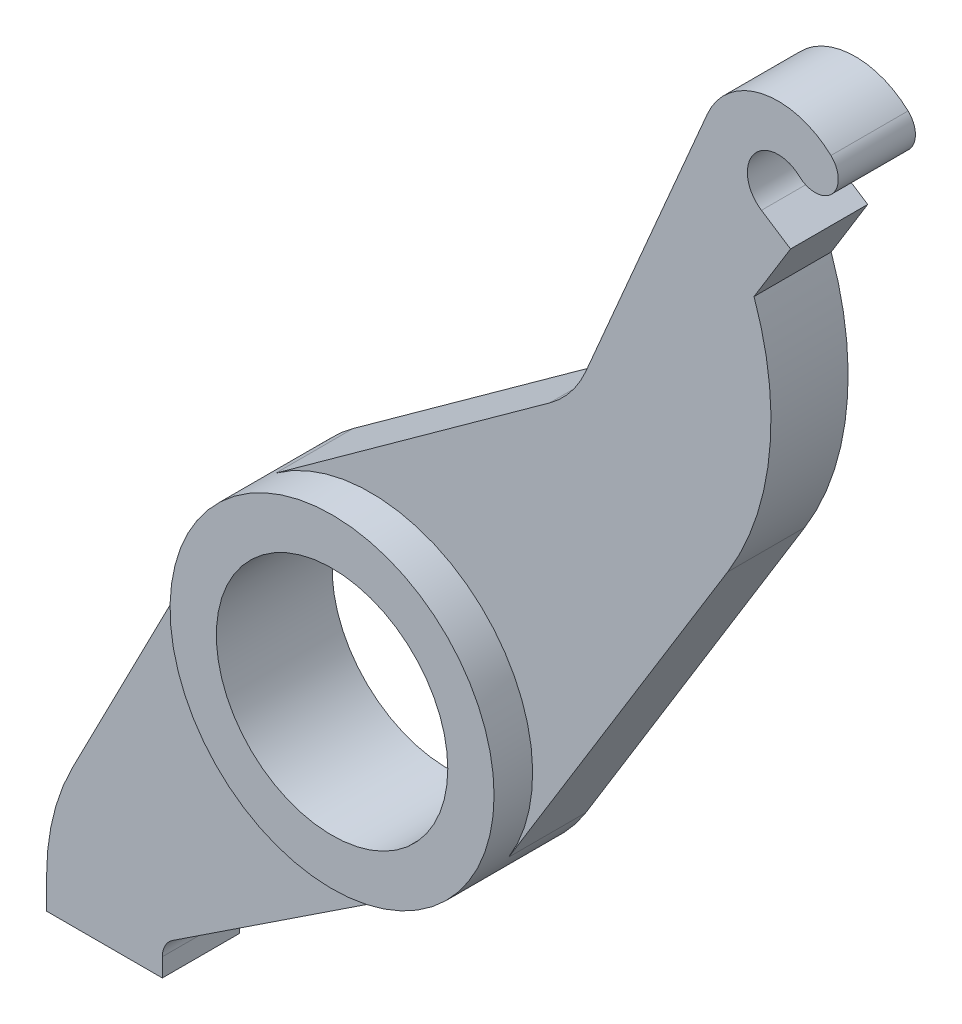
ISO-10303-21;
HEADER;
FILE_DESCRIPTION(('STEP AP214'),'2;1');
FILE_NAME('part.step','',(''),(''),'','','');
FILE_SCHEMA(('AUTOMOTIVE_DESIGN { 1 0 10303 214 1 1 1 1 }'));
ENDSEC;
DATA;
#1=APPLICATION_CONTEXT('core data for automotive mechanical design processes');
#2=APPLICATION_PROTOCOL_DEFINITION('international standard','automotive_design',2000,#1);
#3=PRODUCT_CONTEXT('',#1,'mechanical');
#4=PRODUCT('Part','Part','',(#3));
#5=PRODUCT_RELATED_PRODUCT_CATEGORY('part','',(#4));
#6=PRODUCT_DEFINITION_FORMATION('','',#4);
#7=PRODUCT_DEFINITION_CONTEXT('part definition',#1,'design');
#8=PRODUCT_DEFINITION('design','',#6,#7);
#9=PRODUCT_DEFINITION_SHAPE('','',#8);
#10=(LENGTH_UNIT() NAMED_UNIT(*) SI_UNIT(.MILLI.,.METRE.));
#11=(NAMED_UNIT(*) PLANE_ANGLE_UNIT() SI_UNIT($,.RADIAN.));
#12=(NAMED_UNIT(*) SI_UNIT($,.STERADIAN.) SOLID_ANGLE_UNIT());
#13=UNCERTAINTY_MEASURE_WITH_UNIT(LENGTH_MEASURE(1.E-05),#10,'distance_accuracy_value','');
#14=(GEOMETRIC_REPRESENTATION_CONTEXT(3) GLOBAL_UNCERTAINTY_ASSIGNED_CONTEXT((#13)) GLOBAL_UNIT_ASSIGNED_CONTEXT((#10,
#11,#12)) REPRESENTATION_CONTEXT('',''));
#15=CARTESIAN_POINT('',(0.,0.,0.));
#16=DIRECTION('',(0.,0.,1.));
#17=DIRECTION('',(1.,0.,0.));
#18=AXIS2_PLACEMENT_3D('',#15,#16,#17);
#19=CARTESIAN_POINT('',(0.,0.,10.));
#20=DIRECTION('',(0.,0.,1.));
#21=DIRECTION('',(1.,0.,0.));
#22=AXIS2_PLACEMENT_3D('',#19,#20,#21);
#23=PLANE('',#22);
#24=CARTESIAN_POINT('',(0.,0.,10.));
#25=DIRECTION('',(0.,0.,1.));
#26=DIRECTION('',(1.,0.,0.));
#27=AXIS2_PLACEMENT_3D('',#24,#25,#26);
#28=CIRCLE('',#27,21.);
#29=CARTESIAN_POINT('',(-18.6738380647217,9.60665248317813,10.));
#30=VERTEX_POINT('',#29);
#31=CARTESIAN_POINT('',(11.5735495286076,-17.5229264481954,10.));
#32=VERTEX_POINT('',#31);
#33=EDGE_CURVE('E11',#30,#32,#28,.T.);
#34=ORIENTED_EDGE('',*,*,#33,.F.);
#35=DIRECTION('',(-0.457459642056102,-0.889230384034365,0.));
#36=VECTOR('',#35,1.);
#37=CARTESIAN_POINT('',(-18.6738380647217,9.60665248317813,10.));
#38=LINE('',#37,#36);
#39=CARTESIAN_POINT('',(-38.6769115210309,-29.2762107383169,10.));
#40=VERTEX_POINT('',#39);
#41=EDGE_CURVE('E237',#30,#40,#38,.T.);
#42=ORIENTED_EDGE('',*,*,#41,.T.);
#43=CARTESIAN_POINT('',(-12.,-43.,10.));
#44=DIRECTION('',(0.,0.,1.));
#45=DIRECTION('',(1.,0.,0.));
#46=AXIS2_PLACEMENT_3D('',#43,#44,#45);
#47=CIRCLE('',#46,30.);
#48=CARTESIAN_POINT('',(-42.,-43.,10.));
#49=VERTEX_POINT('',#48);
#50=EDGE_CURVE('E316',#40,#49,#47,.T.);
#51=ORIENTED_EDGE('',*,*,#50,.T.);
#52=DIRECTION('',(0.,-1.,0.));
#53=VECTOR('',#52,1.);
#54=CARTESIAN_POINT('',(-42.,-43.,10.));
#55=LINE('',#54,#53);
#56=CARTESIAN_POINT('',(-42.,-47.,10.));
#57=VERTEX_POINT('',#56);
#58=EDGE_CURVE('E340',#49,#57,#55,.T.);
#59=ORIENTED_EDGE('',*,*,#58,.T.);
#60=DIRECTION('',(1.,0.,0.));
#61=VECTOR('',#60,1.);
#62=CARTESIAN_POINT('',(-42.,-47.,10.));
#63=LINE('',#62,#61);
#64=CARTESIAN_POINT('',(-27.,-47.,10.));
#65=VERTEX_POINT('',#64);
#66=EDGE_CURVE('E342',#57,#65,#63,.T.);
#67=ORIENTED_EDGE('',*,*,#66,.T.);
#68=DIRECTION('',(0.,1.,0.));
#69=VECTOR('',#68,1.);
#70=CARTESIAN_POINT('',(-27.,-47.,10.));
#71=LINE('',#70,#69);
#72=CARTESIAN_POINT('',(-27.,-44.6138486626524,10.));
#73=VERTEX_POINT('',#72);
#74=EDGE_CURVE('E306',#65,#73,#71,.T.);
#75=ORIENTED_EDGE('',*,*,#74,.T.);
#76=CARTESIAN_POINT('',(-24.,-44.6138486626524,10.));
#77=DIRECTION('',(0.,0.,-1.));
#78=DIRECTION('',(-1.,0.,0.));
#79=AXIS2_PLACEMENT_3D('',#76,#77,#78);
#80=CIRCLE('',#79,3.);
#81=CARTESIAN_POINT('',(-25.6533642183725,-42.1105734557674,10.));
#82=VERTEX_POINT('',#81);
#83=EDGE_CURVE('E303',#73,#82,#80,.T.);
#84=ORIENTED_EDGE('',*,*,#83,.T.);
#85=DIRECTION('',(0.834425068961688,0.55112140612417,0.));
#86=VECTOR('',#85,1.);
#87=CARTESIAN_POINT('',(-25.6533642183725,-42.1105734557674,10.));
#88=LINE('',#87,#86);
#89=EDGE_CURVE('E297',#82,#32,#88,.T.);
#90=ORIENTED_EDGE('',*,*,#89,.T.);
#91=EDGE_LOOP('',(#34,#42,#51,#59,#67,#75,#84,#90));
#92=FACE_BOUND('',#91,.T.);
#93=ADVANCED_FACE('F33',(#92),#23,.T.);
#94=CARTESIAN_POINT('',(17.8947067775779,-10.98997130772,10.));
#95=VERTEX_POINT('',#94);
#96=CARTESIAN_POINT('',(-12.2930925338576,17.0258590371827,10.));
#97=VERTEX_POINT('',#96);
#98=EDGE_CURVE('E43',#95,#97,#28,.T.);
#99=ORIENTED_EDGE('',*,*,#98,.F.);
#100=DIRECTION('',(0.523331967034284,0.852128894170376,0.));
#101=VECTOR('',#100,1.);
#102=CARTESIAN_POINT('',(17.8947067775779,-10.98997130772,10.));
#103=LINE('',#102,#101);
#104=CARTESIAN_POINT('',(46.2715525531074,35.215366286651,10.));
#105=VERTEX_POINT('',#104);
#106=EDGE_CURVE('E295',#95,#105,#103,.T.);
#107=ORIENTED_EDGE('',*,*,#106,.T.);
#108=CARTESIAN_POINT('',(13.8906545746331,55.1019810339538,10.));
#109=DIRECTION('',(0.,0.,1.));
#110=DIRECTION('',(1.,0.,0.));
#111=AXIS2_PLACEMENT_3D('',#108,#109,#110);
#112=CIRCLE('',#111,38.);
#113=CARTESIAN_POINT('',(49.6924796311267,67.8389085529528,10.));
#114=VERTEX_POINT('',#113);
#115=EDGE_CURVE('E296',#105,#114,#112,.T.);
#116=ORIENTED_EDGE('',*,*,#115,.T.);
#117=DIRECTION('',(0.523331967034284,0.852128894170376,0.));
#118=VECTOR('',#117,1.);
#119=CARTESIAN_POINT('',(49.6924796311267,67.8389085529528,10.));
#120=LINE('',#119,#118);
#121=CARTESIAN_POINT('',(54.4254478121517,75.5454871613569,10.));
#122=VERTEX_POINT('',#121);
#123=EDGE_CURVE('E301',#114,#122,#120,.T.);
#124=ORIENTED_EDGE('',*,*,#123,.T.);
#125=DIRECTION('',(-0.838670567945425,0.544639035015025,0.));
#126=VECTOR('',#125,1.);
#127=CARTESIAN_POINT('',(54.4254478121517,75.5454871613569,10.));
#128=LINE('',#127,#126);
#129=CARTESIAN_POINT('',(50.6514302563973,77.9963628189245,10.));
#130=VERTEX_POINT('',#129);
#131=EDGE_CURVE('E350',#122,#130,#128,.T.);
#132=ORIENTED_EDGE('',*,*,#131,.T.);
#133=CARTESIAN_POINT('',(52.8299863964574,81.3510450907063,10.));
#134=DIRECTION('',(0.,0.,-1.));
#135=DIRECTION('',(-1.,0.,0.));
#136=AXIS2_PLACEMENT_3D('',#133,#134,#135);
#137=CIRCLE('',#136,4.00000000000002);
#138=CARTESIAN_POINT('',(55.5617749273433,84.2729163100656,10.));
#139=VERTEX_POINT('',#138);
#140=EDGE_CURVE('E352',#130,#139,#137,.T.);
#141=ORIENTED_EDGE('',*,*,#140,.T.);
#142=CARTESIAN_POINT('',(57.6106163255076,86.4643197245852,10.));
#143=DIRECTION('',(0.,0.,1.));
#144=DIRECTION('',(1.,0.,0.));
#145=AXIS2_PLACEMENT_3D('',#142,#143,#144);
#146=CIRCLE('',#145,3.);
#147=CARTESIAN_POINT('',(59.659457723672,88.6557231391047,10.));
#148=VERTEX_POINT('',#147);
#149=EDGE_CURVE('E179',#139,#148,#146,.T.);
#150=ORIENTED_EDGE('',*,*,#149,.T.);
#151=CARTESIAN_POINT('',(52.8299863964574,81.3510450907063,10.));
#152=DIRECTION('',(0.,0.,1.));
#153=DIRECTION('',(1.,0.,0.));
#154=AXIS2_PLACEMENT_3D('',#151,#152,#153);
#155=CIRCLE('',#154,10.);
#156=CARTESIAN_POINT('',(43.6382547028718,85.2895814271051,10.));
#157=VERTEX_POINT('',#156);
#158=EDGE_CURVE('E172',#148,#157,#155,.T.);
#159=ORIENTED_EDGE('',*,*,#158,.T.);
#160=DIRECTION('',(-0.393853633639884,-0.91917316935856,0.));
#161=VECTOR('',#160,1.);
#162=CARTESIAN_POINT('',(43.6382547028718,85.2895814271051,10.));
#163=LINE('',#162,#161);
#164=CARTESIAN_POINT('',(27.8684243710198,48.4860491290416,10.));
#165=VERTEX_POINT('',#164);
#166=EDGE_CURVE('E176',#157,#165,#163,.T.);
#167=ORIENTED_EDGE('',*,*,#166,.T.);
#168=CARTESIAN_POINT('',(15.,54.,10.));
#169=DIRECTION('',(0.,0.,-1.));
#170=DIRECTION('',(-1.,0.,0.));
#171=AXIS2_PLACEMENT_3D('',#168,#169,#170);
#172=CIRCLE('',#171,14.);
#173=CARTESIAN_POINT('',(23.1953950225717,42.6494273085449,10.));
#174=VERTEX_POINT('',#173);
#175=EDGE_CURVE('E52',#165,#174,#172,.T.);
#176=ORIENTED_EDGE('',*,*,#175,.T.);
#177=DIRECTION('',(-0.810755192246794,-0.585385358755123,0.));
#178=VECTOR('',#177,1.);
#179=CARTESIAN_POINT('',(23.1953950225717,42.6494273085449,10.));
#180=LINE('',#179,#178);
#181=EDGE_CURVE('E196',#174,#97,#180,.T.);
#182=ORIENTED_EDGE('',*,*,#181,.T.);
#183=EDGE_LOOP('',(#99,#107,#116,#124,#132,#141,#150,#159,#167,#176,#182));
#184=FACE_BOUND('',#183,.T.);
#185=ADVANCED_FACE('F174',(#184),#23,.T.);
#186=CARTESIAN_POINT('',(0.,0.,0.));
#187=DIRECTION('',(0.,0.,1.));
#188=DIRECTION('',(1.,0.,0.));
#189=AXIS2_PLACEMENT_3D('',#186,#187,#188);
#190=PLANE('',#189);
#191=CARTESIAN_POINT('',(0.,0.,0.));
#192=DIRECTION('',(0.,0.,1.));
#193=DIRECTION('',(1.,0.,0.));
#194=AXIS2_PLACEMENT_3D('',#191,#192,#193);
#195=CIRCLE('',#194,21.);
#196=CARTESIAN_POINT('',(-12.2930925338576,17.0258590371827,0.));
#197=VERTEX_POINT('',#196);
#198=CARTESIAN_POINT('',(-18.6738380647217,9.60665248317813,0.));
#199=VERTEX_POINT('',#198);
#200=EDGE_CURVE('E200',#197,#199,#195,.T.);
#201=ORIENTED_EDGE('',*,*,#200,.F.);
#202=DIRECTION('',(-0.810755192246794,-0.585385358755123,0.));
#203=VECTOR('',#202,1.);
#204=CARTESIAN_POINT('',(23.1953950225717,42.6494273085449,0.));
#205=LINE('',#204,#203);
#206=CARTESIAN_POINT('',(23.1953950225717,42.6494273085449,0.));
#207=VERTEX_POINT('',#206);
#208=EDGE_CURVE('E121',#207,#197,#205,.T.);
#209=ORIENTED_EDGE('',*,*,#208,.F.);
#210=CARTESIAN_POINT('',(15.,54.,0.));
#211=DIRECTION('',(0.,0.,-1.));
#212=DIRECTION('',(-1.,0.,0.));
#213=AXIS2_PLACEMENT_3D('',#210,#211,#212);
#214=CIRCLE('',#213,14.);
#215=CARTESIAN_POINT('',(27.8684243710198,48.4860491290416,0.));
#216=VERTEX_POINT('',#215);
#217=EDGE_CURVE('E114',#216,#207,#214,.T.);
#218=ORIENTED_EDGE('',*,*,#217,.F.);
#219=DIRECTION('',(-0.393853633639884,-0.91917316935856,0.));
#220=VECTOR('',#219,1.);
#221=CARTESIAN_POINT('',(43.6382547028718,85.2895814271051,0.));
#222=LINE('',#221,#220);
#223=CARTESIAN_POINT('',(43.6382547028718,85.2895814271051,0.));
#224=VERTEX_POINT('',#223);
#225=EDGE_CURVE('E233',#224,#216,#222,.T.);
#226=ORIENTED_EDGE('',*,*,#225,.F.);
#227=CARTESIAN_POINT('',(52.8299863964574,81.3510450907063,0.));
#228=DIRECTION('',(0.,0.,1.));
#229=DIRECTION('',(1.,0.,0.));
#230=AXIS2_PLACEMENT_3D('',#227,#228,#229);
#231=CIRCLE('',#230,10.);
#232=CARTESIAN_POINT('',(59.659457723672,88.6557231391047,0.));
#233=VERTEX_POINT('',#232);
#234=EDGE_CURVE('E188',#233,#224,#231,.T.);
#235=ORIENTED_EDGE('',*,*,#234,.F.);
#236=CARTESIAN_POINT('',(57.6106163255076,86.4643197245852,0.));
#237=DIRECTION('',(0.,0.,1.));
#238=DIRECTION('',(1.,0.,0.));
#239=AXIS2_PLACEMENT_3D('',#236,#237,#238);
#240=CIRCLE('',#239,3.);
#241=CARTESIAN_POINT('',(55.5617749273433,84.2729163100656,0.));
#242=VERTEX_POINT('',#241);
#243=EDGE_CURVE('E230',#242,#233,#240,.T.);
#244=ORIENTED_EDGE('',*,*,#243,.F.);
#245=CARTESIAN_POINT('',(52.8299863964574,81.3510450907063,0.));
#246=DIRECTION('',(0.,0.,-1.));
#247=DIRECTION('',(-1.,0.,0.));
#248=AXIS2_PLACEMENT_3D('',#245,#246,#247);
#249=CIRCLE('',#248,4.00000000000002);
#250=CARTESIAN_POINT('',(50.6514302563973,77.9963628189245,0.));
#251=VERTEX_POINT('',#250);
#252=EDGE_CURVE('E228',#251,#242,#249,.T.);
#253=ORIENTED_EDGE('',*,*,#252,.F.);
#254=DIRECTION('',(-0.838670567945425,0.544639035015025,0.));
#255=VECTOR('',#254,1.);
#256=CARTESIAN_POINT('',(54.4254478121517,75.5454871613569,0.));
#257=LINE('',#256,#255);
#258=CARTESIAN_POINT('',(54.4254478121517,75.5454871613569,0.));
#259=VERTEX_POINT('',#258);
#260=EDGE_CURVE('E226',#259,#251,#257,.T.);
#261=ORIENTED_EDGE('',*,*,#260,.F.);
#262=DIRECTION('',(0.523331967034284,0.852128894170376,0.));
#263=VECTOR('',#262,1.);
#264=CARTESIAN_POINT('',(49.6924796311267,67.8389085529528,0.));
#265=LINE('',#264,#263);
#266=CARTESIAN_POINT('',(49.6924796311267,67.8389085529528,0.));
#267=VERTEX_POINT('',#266);
#268=EDGE_CURVE('E224',#267,#259,#265,.T.);
#269=ORIENTED_EDGE('',*,*,#268,.F.);
#270=CARTESIAN_POINT('',(13.8906545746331,55.1019810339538,0.));
#271=DIRECTION('',(0.,0.,1.));
#272=DIRECTION('',(1.,0.,0.));
#273=AXIS2_PLACEMENT_3D('',#270,#271,#272);
#274=CIRCLE('',#273,38.);
#275=CARTESIAN_POINT('',(46.2715525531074,35.215366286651,0.));
#276=VERTEX_POINT('',#275);
#277=EDGE_CURVE('E222',#276,#267,#274,.T.);
#278=ORIENTED_EDGE('',*,*,#277,.F.);
#279=DIRECTION('',(0.523331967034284,0.852128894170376,0.));
#280=VECTOR('',#279,1.);
#281=CARTESIAN_POINT('',(17.8947067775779,-10.98997130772,0.));
#282=LINE('',#281,#280);
#283=CARTESIAN_POINT('',(17.8947067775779,-10.98997130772,0.));
#284=VERTEX_POINT('',#283);
#285=EDGE_CURVE('E220',#284,#276,#282,.T.);
#286=ORIENTED_EDGE('',*,*,#285,.F.);
#287=CARTESIAN_POINT('',(0.,0.,0.));
#288=DIRECTION('',(0.,0.,1.));
#289=DIRECTION('',(1.,0.,0.));
#290=AXIS2_PLACEMENT_3D('',#287,#288,#289);
#291=CIRCLE('',#290,21.);
#292=CARTESIAN_POINT('',(11.5735495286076,-17.5229264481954,0.));
#293=VERTEX_POINT('',#292);
#294=EDGE_CURVE('E218',#293,#284,#291,.T.);
#295=ORIENTED_EDGE('',*,*,#294,.F.);
#296=DIRECTION('',(0.834425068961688,0.55112140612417,0.));
#297=VECTOR('',#296,1.);
#298=CARTESIAN_POINT('',(-25.6533642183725,-42.1105734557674,0.));
#299=LINE('',#298,#297);
#300=CARTESIAN_POINT('',(-25.6533642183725,-42.1105734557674,0.));
#301=VERTEX_POINT('',#300);
#302=EDGE_CURVE('E216',#301,#293,#299,.T.);
#303=ORIENTED_EDGE('',*,*,#302,.F.);
#304=CARTESIAN_POINT('',(-24.,-44.6138486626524,0.));
#305=DIRECTION('',(0.,0.,-1.));
#306=DIRECTION('',(-1.,0.,0.));
#307=AXIS2_PLACEMENT_3D('',#304,#305,#306);
#308=CIRCLE('',#307,3.);
#309=CARTESIAN_POINT('',(-27.,-44.6138486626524,0.));
#310=VERTEX_POINT('',#309);
#311=EDGE_CURVE('E214',#310,#301,#308,.T.);
#312=ORIENTED_EDGE('',*,*,#311,.F.);
#313=DIRECTION('',(0.,1.,0.));
#314=VECTOR('',#313,1.);
#315=CARTESIAN_POINT('',(-27.,-47.,0.));
#316=LINE('',#315,#314);
#317=CARTESIAN_POINT('',(-27.,-47.,0.));
#318=VERTEX_POINT('',#317);
#319=EDGE_CURVE('E212',#318,#310,#316,.T.);
#320=ORIENTED_EDGE('',*,*,#319,.F.);
#321=DIRECTION('',(1.,0.,0.));
#322=VECTOR('',#321,1.);
#323=CARTESIAN_POINT('',(-42.,-47.,0.));
#324=LINE('',#323,#322);
#325=CARTESIAN_POINT('',(-42.,-47.,0.));
#326=VERTEX_POINT('',#325);
#327=EDGE_CURVE('E210',#326,#318,#324,.T.);
#328=ORIENTED_EDGE('',*,*,#327,.F.);
#329=DIRECTION('',(0.,-1.,0.));
#330=VECTOR('',#329,1.);
#331=CARTESIAN_POINT('',(-42.,-43.,0.));
#332=LINE('',#331,#330);
#333=CARTESIAN_POINT('',(-42.,-43.,0.));
#334=VERTEX_POINT('',#333);
#335=EDGE_CURVE('E208',#334,#326,#332,.T.);
#336=ORIENTED_EDGE('',*,*,#335,.F.);
#337=CARTESIAN_POINT('',(-12.,-43.,0.));
#338=DIRECTION('',(0.,0.,1.));
#339=DIRECTION('',(1.,0.,0.));
#340=AXIS2_PLACEMENT_3D('',#337,#338,#339);
#341=CIRCLE('',#340,30.);
#342=CARTESIAN_POINT('',(-38.6769115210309,-29.2762107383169,0.));
#343=VERTEX_POINT('',#342);
#344=EDGE_CURVE('E206',#343,#334,#341,.T.);
#345=ORIENTED_EDGE('',*,*,#344,.F.);
#346=DIRECTION('',(-0.457459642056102,-0.889230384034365,0.));
#347=VECTOR('',#346,1.);
#348=CARTESIAN_POINT('',(-18.6738380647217,9.60665248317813,0.));
#349=LINE('',#348,#347);
#350=EDGE_CURVE('E203',#199,#343,#349,.T.);
#351=ORIENTED_EDGE('',*,*,#350,.F.);
#352=EDGE_LOOP('',(#201,#209,#218,#226,#235,#244,#253,#261,#269,#278,#286,#295,#303,#312,#320,
#328,#336,#345,#351));
#353=FACE_BOUND('',#352,.T.);
#354=CARTESIAN_POINT('',(0.,0.,0.));
#355=DIRECTION('',(0.,0.,1.));
#356=DIRECTION('',(1.,0.,0.));
#357=AXIS2_PLACEMENT_3D('',#354,#355,#356);
#358=CIRCLE('',#357,15.);
#359=CARTESIAN_POINT('',(15.,0.,0.));
#360=VERTEX_POINT('',#359);
#361=EDGE_CURVE('E204',#360,#360,#358,.T.);
#362=ORIENTED_EDGE('',*,*,#361,.T.);
#363=EDGE_LOOP('',(#362));
#364=FACE_BOUND('',#363,.T.);
#365=ADVANCED_FACE('F327',(#353,#364),#190,.F.);
#366=CARTESIAN_POINT('',(-18.6738380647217,9.60665248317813,10.));
#367=DIRECTION('',(0.889230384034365,-0.457459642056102,0.));
#368=DIRECTION('',(0.457459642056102,0.889230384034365,0.));
#369=AXIS2_PLACEMENT_3D('',#366,#367,#368);
#370=PLANE('',#369);
#371=ORIENTED_EDGE('',*,*,#350,.T.);
#372=DIRECTION('',(0.,0.,-1.));
#373=VECTOR('',#372,1.);
#374=CARTESIAN_POINT('',(-38.6769115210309,-29.2762107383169,10.));
#375=LINE('',#374,#373);
#376=EDGE_CURVE('E275',#40,#343,#375,.T.);
#377=ORIENTED_EDGE('',*,*,#376,.F.);
#378=ORIENTED_EDGE('',*,*,#41,.F.);
#379=DIRECTION('',(0.,0.,-1.));
#380=VECTOR('',#379,1.);
#381=CARTESIAN_POINT('',(-18.6738380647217,9.60665248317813,10.));
#382=LINE('',#381,#380);
#383=EDGE_CURVE('E278',#30,#199,#382,.T.);
#384=ORIENTED_EDGE('',*,*,#383,.T.);
#385=EDGE_LOOP('',(#371,#377,#378,#384));
#386=FACE_BOUND('',#385,.T.);
#387=ADVANCED_FACE('F35',(#386),#370,.F.);
#388=CARTESIAN_POINT('',(-12.,-43.,10.));
#389=DIRECTION('',(0.,0.,-1.));
#390=DIRECTION('',(-1.,0.,0.));
#391=AXIS2_PLACEMENT_3D('',#388,#389,#390);
#392=CYLINDRICAL_SURFACE('',#391,30.);
#393=ORIENTED_EDGE('',*,*,#344,.T.);
#394=DIRECTION('',(0.,0.,-1.));
#395=VECTOR('',#394,1.);
#396=CARTESIAN_POINT('',(-42.,-43.,10.));
#397=LINE('',#396,#395);
#398=EDGE_CURVE('E272',#49,#334,#397,.T.);
#399=ORIENTED_EDGE('',*,*,#398,.F.);
#400=ORIENTED_EDGE('',*,*,#50,.F.);
#401=ORIENTED_EDGE('',*,*,#376,.T.);
#402=EDGE_LOOP('',(#393,#399,#400,#401));
#403=FACE_BOUND('',#402,.T.);
#404=ADVANCED_FACE('F334',(#403),#392,.T.);
#405=CARTESIAN_POINT('',(-42.,-43.,10.));
#406=DIRECTION('',(1.,0.,0.));
#407=DIRECTION('',(0.,0.,-1.));
#408=AXIS2_PLACEMENT_3D('',#405,#406,#407);
#409=PLANE('',#408);
#410=ORIENTED_EDGE('',*,*,#335,.T.);
#411=DIRECTION('',(0.,0.,-1.));
#412=VECTOR('',#411,1.);
#413=CARTESIAN_POINT('',(-42.,-47.,10.));
#414=LINE('',#413,#412);
#415=EDGE_CURVE('E269',#57,#326,#414,.T.);
#416=ORIENTED_EDGE('',*,*,#415,.F.);
#417=ORIENTED_EDGE('',*,*,#58,.F.);
#418=ORIENTED_EDGE('',*,*,#398,.T.);
#419=EDGE_LOOP('',(#410,#416,#417,#418));
#420=FACE_BOUND('',#419,.T.);
#421=ADVANCED_FACE('F338',(#420),#409,.F.);
#422=CARTESIAN_POINT('',(-42.,-47.,10.));
#423=DIRECTION('',(0.,1.,0.));
#424=DIRECTION('',(0.,0.,1.));
#425=AXIS2_PLACEMENT_3D('',#422,#423,#424);
#426=PLANE('',#425);
#427=ORIENTED_EDGE('',*,*,#327,.T.);
#428=DIRECTION('',(0.,0.,-1.));
#429=VECTOR('',#428,1.);
#430=CARTESIAN_POINT('',(-27.,-47.,10.));
#431=LINE('',#430,#429);
#432=EDGE_CURVE('E266',#65,#318,#431,.T.);
#433=ORIENTED_EDGE('',*,*,#432,.F.);
#434=ORIENTED_EDGE('',*,*,#66,.F.);
#435=ORIENTED_EDGE('',*,*,#415,.T.);
#436=EDGE_LOOP('',(#427,#433,#434,#435));
#437=FACE_BOUND('',#436,.T.);
#438=ADVANCED_FACE('F400',(#437),#426,.F.);
#439=CARTESIAN_POINT('',(-27.,-47.,10.));
#440=DIRECTION('',(-1.,0.,0.));
#441=DIRECTION('',(0.,-1.,0.));
#442=AXIS2_PLACEMENT_3D('',#439,#440,#441);
#443=PLANE('',#442);
#444=ORIENTED_EDGE('',*,*,#319,.T.);
#445=DIRECTION('',(0.,0.,-1.));
#446=VECTOR('',#445,1.);
#447=CARTESIAN_POINT('',(-27.,-44.6138486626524,10.));
#448=LINE('',#447,#446);
#449=EDGE_CURVE('E262',#73,#310,#448,.T.);
#450=ORIENTED_EDGE('',*,*,#449,.F.);
#451=ORIENTED_EDGE('',*,*,#74,.F.);
#452=ORIENTED_EDGE('',*,*,#432,.T.);
#453=EDGE_LOOP('',(#444,#450,#451,#452));
#454=FACE_BOUND('',#453,.T.);
#455=ADVANCED_FACE('F397',(#454),#443,.F.);
#456=CARTESIAN_POINT('',(-24.,-44.6138486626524,10.));
#457=DIRECTION('',(0.,0.,-1.));
#458=DIRECTION('',(-1.,0.,0.));
#459=AXIS2_PLACEMENT_3D('',#456,#457,#458);
#460=CYLINDRICAL_SURFACE('',#459,3.);
#461=ORIENTED_EDGE('',*,*,#311,.T.);
#462=DIRECTION('',(0.,0.,-1.));
#463=VECTOR('',#462,1.);
#464=CARTESIAN_POINT('',(-25.6533642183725,-42.1105734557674,10.));
#465=LINE('',#464,#463);
#466=EDGE_CURVE('E259',#82,#301,#465,.T.);
#467=ORIENTED_EDGE('',*,*,#466,.F.);
#468=ORIENTED_EDGE('',*,*,#83,.F.);
#469=ORIENTED_EDGE('',*,*,#449,.T.);
#470=EDGE_LOOP('',(#461,#467,#468,#469));
#471=FACE_BOUND('',#470,.T.);
#472=ADVANCED_FACE('F393',(#471),#460,.F.);
#473=CARTESIAN_POINT('',(-25.6533642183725,-42.1105734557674,10.));
#474=DIRECTION('',(-0.55112140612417,0.834425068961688,0.));
#475=DIRECTION('',(-0.834425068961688,-0.55112140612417,0.));
#476=AXIS2_PLACEMENT_3D('',#473,#474,#475);
#477=PLANE('',#476);
#478=ORIENTED_EDGE('',*,*,#302,.T.);
#479=DIRECTION('',(0.,0.,-1.));
#480=VECTOR('',#479,1.);
#481=CARTESIAN_POINT('',(11.5735495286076,-17.5229264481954,10.));
#482=LINE('',#481,#480);
#483=EDGE_CURVE('E263',#32,#293,#482,.T.);
#484=ORIENTED_EDGE('',*,*,#483,.F.);
#485=ORIENTED_EDGE('',*,*,#89,.F.);
#486=ORIENTED_EDGE('',*,*,#466,.T.);
#487=EDGE_LOOP('',(#478,#484,#485,#486));
#488=FACE_BOUND('',#487,.T.);
#489=ADVANCED_FACE('F389',(#488),#477,.F.);
#490=CARTESIAN_POINT('',(0.,0.,10.));
#491=DIRECTION('',(0.,0.,-1.));
#492=DIRECTION('',(-1.,0.,0.));
#493=AXIS2_PLACEMENT_3D('',#490,#491,#492);
#494=CYLINDRICAL_SURFACE('',#493,21.);
#495=ORIENTED_EDGE('',*,*,#294,.T.);
#496=DIRECTION('',(0.,0.,-1.));
#497=VECTOR('',#496,1.);
#498=CARTESIAN_POINT('',(17.8947067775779,-10.98997130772,10.));
#499=LINE('',#498,#497);
#500=EDGE_CURVE('E258',#95,#284,#499,.T.);
#501=ORIENTED_EDGE('',*,*,#500,.F.);
#502=ORIENTED_EDGE('',*,*,#98,.T.);
#503=DIRECTION('',(0.,0.,-1.));
#504=VECTOR('',#503,1.);
#505=CARTESIAN_POINT('',(-12.2930925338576,17.0258590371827,10.));
#506=LINE('',#505,#504);
#507=EDGE_CURVE('E240',#97,#197,#506,.T.);
#508=ORIENTED_EDGE('',*,*,#507,.T.);
#509=ORIENTED_EDGE('',*,*,#200,.T.);
#510=ORIENTED_EDGE('',*,*,#383,.F.);
#511=ORIENTED_EDGE('',*,*,#33,.T.);
#512=ORIENTED_EDGE('',*,*,#483,.T.);
#513=EDGE_LOOP('',(#495,#501,#502,#508,#509,#510,#511,#512));
#514=FACE_BOUND('',#513,.T.);
#515=CARTESIAN_POINT('',(0.,0.,15.));
#516=DIRECTION('',(0.,0.,1.));
#517=DIRECTION('',(1.,0.,0.));
#518=AXIS2_PLACEMENT_3D('',#515,#516,#517);
#519=CIRCLE('',#518,21.);
#520=CARTESIAN_POINT('',(21.,0.,15.));
#521=VERTEX_POINT('',#520);
#522=EDGE_CURVE('E588',#521,#521,#519,.T.);
#523=ORIENTED_EDGE('',*,*,#522,.F.);
#524=EDGE_LOOP('',(#523));
#525=FACE_BOUND('',#524,.T.);
#526=ADVANCED_FACE('F324',(#514,#525),#494,.T.);
#527=CARTESIAN_POINT('',(17.8947067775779,-10.98997130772,10.));
#528=DIRECTION('',(-0.852128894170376,0.523331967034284,0.));
#529=DIRECTION('',(-0.523331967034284,-0.852128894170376,0.));
#530=AXIS2_PLACEMENT_3D('',#527,#528,#529);
#531=PLANE('',#530);
#532=ORIENTED_EDGE('',*,*,#285,.T.);
#533=DIRECTION('',(0.,0.,-1.));
#534=VECTOR('',#533,1.);
#535=CARTESIAN_POINT('',(46.2715525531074,35.215366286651,10.));
#536=LINE('',#535,#534);
#537=EDGE_CURVE('E255',#105,#276,#536,.T.);
#538=ORIENTED_EDGE('',*,*,#537,.F.);
#539=ORIENTED_EDGE('',*,*,#106,.F.);
#540=ORIENTED_EDGE('',*,*,#500,.T.);
#541=EDGE_LOOP('',(#532,#538,#539,#540));
#542=FACE_BOUND('',#541,.T.);
#543=ADVANCED_FACE('F371',(#542),#531,.F.);
#544=CARTESIAN_POINT('',(13.8906545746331,55.1019810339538,10.));
#545=DIRECTION('',(0.,0.,-1.));
#546=DIRECTION('',(-1.,0.,0.));
#547=AXIS2_PLACEMENT_3D('',#544,#545,#546);
#548=CYLINDRICAL_SURFACE('',#547,38.);
#549=ORIENTED_EDGE('',*,*,#277,.T.);
#550=DIRECTION('',(0.,0.,-1.));
#551=VECTOR('',#550,1.);
#552=CARTESIAN_POINT('',(49.6924796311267,67.8389085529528,10.));
#553=LINE('',#552,#551);
#554=EDGE_CURVE('E252',#114,#267,#553,.T.);
#555=ORIENTED_EDGE('',*,*,#554,.F.);
#556=ORIENTED_EDGE('',*,*,#115,.F.);
#557=ORIENTED_EDGE('',*,*,#537,.T.);
#558=EDGE_LOOP('',(#549,#555,#556,#557));
#559=FACE_BOUND('',#558,.T.);
#560=ADVANCED_FACE('F376',(#559),#548,.T.);
#561=CARTESIAN_POINT('',(49.6924796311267,67.8389085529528,10.));
#562=DIRECTION('',(-0.852128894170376,0.523331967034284,0.));
#563=DIRECTION('',(-0.523331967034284,-0.852128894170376,0.));
#564=AXIS2_PLACEMENT_3D('',#561,#562,#563);
#565=PLANE('',#564);
#566=ORIENTED_EDGE('',*,*,#268,.T.);
#567=DIRECTION('',(0.,0.,-1.));
#568=VECTOR('',#567,1.);
#569=CARTESIAN_POINT('',(54.4254478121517,75.5454871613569,10.));
#570=LINE('',#569,#568);
#571=EDGE_CURVE('E249',#122,#259,#570,.T.);
#572=ORIENTED_EDGE('',*,*,#571,.F.);
#573=ORIENTED_EDGE('',*,*,#123,.F.);
#574=ORIENTED_EDGE('',*,*,#554,.T.);
#575=EDGE_LOOP('',(#566,#572,#573,#574));
#576=FACE_BOUND('',#575,.T.);
#577=ADVANCED_FACE('F380',(#576),#565,.F.);
#578=CARTESIAN_POINT('',(54.4254478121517,75.5454871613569,10.));
#579=DIRECTION('',(-0.544639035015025,-0.838670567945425,0.));
#580=DIRECTION('',(0.838670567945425,-0.544639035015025,0.));
#581=AXIS2_PLACEMENT_3D('',#578,#579,#580);
#582=PLANE('',#581);
#583=ORIENTED_EDGE('',*,*,#260,.T.);
#584=DIRECTION('',(0.,0.,-1.));
#585=VECTOR('',#584,1.);
#586=CARTESIAN_POINT('',(50.6514302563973,77.9963628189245,10.));
#587=LINE('',#586,#585);
#588=EDGE_CURVE('E246',#130,#251,#587,.T.);
#589=ORIENTED_EDGE('',*,*,#588,.F.);
#590=ORIENTED_EDGE('',*,*,#131,.F.);
#591=ORIENTED_EDGE('',*,*,#571,.T.);
#592=EDGE_LOOP('',(#583,#589,#590,#591));
#593=FACE_BOUND('',#592,.T.);
#594=ADVANCED_FACE('F384',(#593),#582,.F.);
#595=CARTESIAN_POINT('',(52.8299863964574,81.3510450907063,10.));
#596=DIRECTION('',(0.,0.,-1.));
#597=DIRECTION('',(-1.,0.,0.));
#598=AXIS2_PLACEMENT_3D('',#595,#596,#597);
#599=CYLINDRICAL_SURFACE('',#598,4.00000000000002);
#600=ORIENTED_EDGE('',*,*,#252,.T.);
#601=DIRECTION('',(0.,0.,-1.));
#602=VECTOR('',#601,1.);
#603=CARTESIAN_POINT('',(55.5617749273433,84.2729163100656,10.));
#604=LINE('',#603,#602);
#605=EDGE_CURVE('E243',#139,#242,#604,.T.);
#606=ORIENTED_EDGE('',*,*,#605,.F.);
#607=ORIENTED_EDGE('',*,*,#140,.F.);
#608=ORIENTED_EDGE('',*,*,#588,.T.);
#609=EDGE_LOOP('',(#600,#606,#607,#608));
#610=FACE_BOUND('',#609,.T.);
#611=ADVANCED_FACE('F358',(#610),#599,.F.);
#612=CARTESIAN_POINT('',(57.6106163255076,86.4643197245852,10.));
#613=DIRECTION('',(0.,0.,-1.));
#614=DIRECTION('',(-1.,0.,0.));
#615=AXIS2_PLACEMENT_3D('',#612,#613,#614);
#616=CYLINDRICAL_SURFACE('',#615,3.);
#617=ORIENTED_EDGE('',*,*,#243,.T.);
#618=DIRECTION('',(0.,0.,-1.));
#619=VECTOR('',#618,1.);
#620=CARTESIAN_POINT('',(59.659457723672,88.6557231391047,10.));
#621=LINE('',#620,#619);
#622=EDGE_CURVE('E191',#148,#233,#621,.T.);
#623=ORIENTED_EDGE('',*,*,#622,.F.);
#624=ORIENTED_EDGE('',*,*,#149,.F.);
#625=ORIENTED_EDGE('',*,*,#605,.T.);
#626=EDGE_LOOP('',(#617,#623,#624,#625));
#627=FACE_BOUND('',#626,.T.);
#628=ADVANCED_FACE('F362',(#627),#616,.T.);
#629=CARTESIAN_POINT('',(52.8299863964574,81.3510450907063,10.));
#630=DIRECTION('',(0.,0.,-1.));
#631=DIRECTION('',(-1.,0.,0.));
#632=AXIS2_PLACEMENT_3D('',#629,#630,#631);
#633=CYLINDRICAL_SURFACE('',#632,10.);
#634=ORIENTED_EDGE('',*,*,#234,.T.);
#635=DIRECTION('',(0.,0.,-1.));
#636=VECTOR('',#635,1.);
#637=CARTESIAN_POINT('',(43.6382547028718,85.2895814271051,10.));
#638=LINE('',#637,#636);
#639=EDGE_CURVE('E185',#157,#224,#638,.T.);
#640=ORIENTED_EDGE('',*,*,#639,.F.);
#641=ORIENTED_EDGE('',*,*,#158,.F.);
#642=ORIENTED_EDGE('',*,*,#622,.T.);
#643=EDGE_LOOP('',(#634,#640,#641,#642));
#644=FACE_BOUND('',#643,.T.);
#645=ADVANCED_FACE('F186',(#644),#633,.T.);
#646=CARTESIAN_POINT('',(43.6382547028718,85.2895814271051,10.));
#647=DIRECTION('',(0.91917316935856,-0.393853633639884,0.));
#648=DIRECTION('',(0.393853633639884,0.91917316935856,0.));
#649=AXIS2_PLACEMENT_3D('',#646,#647,#648);
#650=PLANE('',#649);
#651=ORIENTED_EDGE('',*,*,#225,.T.);
#652=DIRECTION('',(0.,0.,-1.));
#653=VECTOR('',#652,1.);
#654=CARTESIAN_POINT('',(27.8684243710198,48.4860491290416,10.));
#655=LINE('',#654,#653);
#656=EDGE_CURVE('E192',#165,#216,#655,.T.);
#657=ORIENTED_EDGE('',*,*,#656,.F.);
#658=ORIENTED_EDGE('',*,*,#166,.F.);
#659=ORIENTED_EDGE('',*,*,#639,.T.);
#660=EDGE_LOOP('',(#651,#657,#658,#659));
#661=FACE_BOUND('',#660,.T.);
#662=ADVANCED_FACE('F194',(#661),#650,.F.);
#663=CARTESIAN_POINT('',(15.,54.,10.));
#664=DIRECTION('',(0.,0.,-1.));
#665=DIRECTION('',(-1.,0.,0.));
#666=AXIS2_PLACEMENT_3D('',#663,#664,#665);
#667=CYLINDRICAL_SURFACE('',#666,14.);
#668=ORIENTED_EDGE('',*,*,#217,.T.);
#669=DIRECTION('',(0.,0.,-1.));
#670=VECTOR('',#669,1.);
#671=CARTESIAN_POINT('',(23.1953950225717,42.6494273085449,10.));
#672=LINE('',#671,#670);
#673=EDGE_CURVE('E238',#174,#207,#672,.T.);
#674=ORIENTED_EDGE('',*,*,#673,.F.);
#675=ORIENTED_EDGE('',*,*,#175,.F.);
#676=ORIENTED_EDGE('',*,*,#656,.T.);
#677=EDGE_LOOP('',(#668,#674,#675,#676));
#678=FACE_BOUND('',#677,.T.);
#679=ADVANCED_FACE('F363',(#678),#667,.F.);
#680=CARTESIAN_POINT('',(23.1953950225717,42.6494273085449,10.));
#681=DIRECTION('',(0.585385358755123,-0.810755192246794,0.));
#682=DIRECTION('',(0.810755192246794,0.585385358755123,0.));
#683=AXIS2_PLACEMENT_3D('',#680,#681,#682);
#684=PLANE('',#683);
#685=ORIENTED_EDGE('',*,*,#208,.T.);
#686=ORIENTED_EDGE('',*,*,#507,.F.);
#687=ORIENTED_EDGE('',*,*,#181,.F.);
#688=ORIENTED_EDGE('',*,*,#673,.T.);
#689=EDGE_LOOP('',(#685,#686,#687,#688));
#690=FACE_BOUND('',#689,.T.);
#691=ADVANCED_FACE('F365',(#690),#684,.F.);
#692=CARTESIAN_POINT('',(0.,0.,10.));
#693=DIRECTION('',(0.,0.,-1.));
#694=DIRECTION('',(-1.,0.,0.));
#695=AXIS2_PLACEMENT_3D('',#692,#693,#694);
#696=CYLINDRICAL_SURFACE('',#695,15.);
#697=ORIENTED_EDGE('',*,*,#361,.F.);
#698=EDGE_LOOP('',(#697));
#699=FACE_BOUND('',#698,.T.);
#700=CARTESIAN_POINT('',(0.,0.,15.));
#701=DIRECTION('',(0.,0.,1.));
#702=DIRECTION('',(1.,0.,0.));
#703=AXIS2_PLACEMENT_3D('',#700,#701,#702);
#704=CIRCLE('',#703,15.);
#705=CARTESIAN_POINT('',(15.,0.,15.));
#706=VERTEX_POINT('',#705);
#707=EDGE_CURVE('E591',#706,#706,#704,.T.);
#708=ORIENTED_EDGE('',*,*,#707,.T.);
#709=EDGE_LOOP('',(#708));
#710=FACE_BOUND('',#709,.T.);
#711=ADVANCED_FACE('F408',(#699,#710),#696,.F.);
#712=CARTESIAN_POINT('',(0.,0.,15.));
#713=DIRECTION('',(0.,0.,1.));
#714=DIRECTION('',(1.,0.,0.));
#715=AXIS2_PLACEMENT_3D('',#712,#713,#714);
#716=PLANE('',#715);
#717=ORIENTED_EDGE('',*,*,#522,.T.);
#718=EDGE_LOOP('',(#717));
#719=FACE_BOUND('',#718,.T.);
#720=ORIENTED_EDGE('',*,*,#707,.F.);
#721=EDGE_LOOP('',(#720));
#722=FACE_BOUND('',#721,.T.);
#723=ADVANCED_FACE('F573',(#719,#722),#716,.T.);
#724=CLOSED_SHELL('',(#93,#185,#365,#387,#404,#421,#438,#455,#472,#489,#526,#543,#560,#577,#594,
#611,#628,#645,#662,#679,#691,#711,#723));
#725=MANIFOLD_SOLID_BREP('B2',#724);
#726=ADVANCED_BREP_SHAPE_REPRESENTATION('',(#18,#725),#14);
#727=SHAPE_DEFINITION_REPRESENTATION(#9,#726);
ENDSEC;
END-ISO-10303-21;
